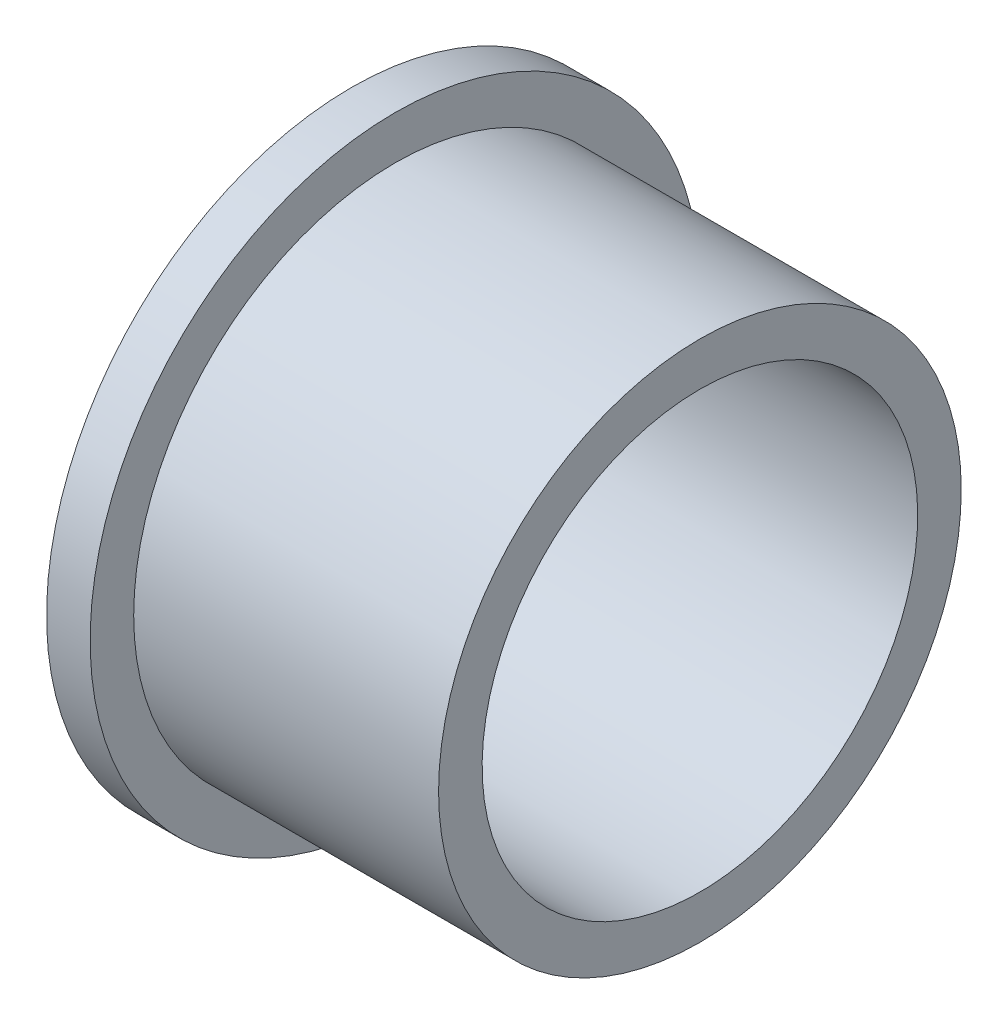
ISO-10303-21;
HEADER;
FILE_DESCRIPTION(('STEP AP214'),'2;1');
FILE_NAME('part.step','',(''),(''),'','','');
FILE_SCHEMA(('AUTOMOTIVE_DESIGN { 1 0 10303 214 1 1 1 1 }'));
ENDSEC;
DATA;
#1=APPLICATION_CONTEXT('core data for automotive mechanical design processes');
#2=APPLICATION_PROTOCOL_DEFINITION('international standard','automotive_design',2000,#1);
#3=PRODUCT_CONTEXT('',#1,'mechanical');
#4=PRODUCT('Part','Part','',(#3));
#5=PRODUCT_RELATED_PRODUCT_CATEGORY('part','',(#4));
#6=PRODUCT_DEFINITION_FORMATION('','',#4);
#7=PRODUCT_DEFINITION_CONTEXT('part definition',#1,'design');
#8=PRODUCT_DEFINITION('design','',#6,#7);
#9=PRODUCT_DEFINITION_SHAPE('','',#8);
#10=(LENGTH_UNIT() NAMED_UNIT(*) SI_UNIT(.MILLI.,.METRE.));
#11=(NAMED_UNIT(*) PLANE_ANGLE_UNIT() SI_UNIT($,.RADIAN.));
#12=(NAMED_UNIT(*) SI_UNIT($,.STERADIAN.) SOLID_ANGLE_UNIT());
#13=UNCERTAINTY_MEASURE_WITH_UNIT(LENGTH_MEASURE(1.E-05),#10,'distance_accuracy_value','');
#14=(GEOMETRIC_REPRESENTATION_CONTEXT(3) GLOBAL_UNCERTAINTY_ASSIGNED_CONTEXT((#13)) GLOBAL_UNIT_ASSIGNED_CONTEXT((#10,
#11,#12)) REPRESENTATION_CONTEXT('',''));
#15=CARTESIAN_POINT('',(0.,0.,0.));
#16=DIRECTION('',(0.,0.,1.));
#17=DIRECTION('',(1.,0.,0.));
#18=AXIS2_PLACEMENT_3D('',#15,#16,#17);
#19=CARTESIAN_POINT('',(0.,0.,0.));
#20=DIRECTION('',(1.,0.,0.));
#21=DIRECTION('',(0.,1.,0.));
#22=AXIS2_PLACEMENT_3D('',#19,#20,#21);
#23=CYLINDRICAL_SURFACE('',#22,17.5);
#24=CARTESIAN_POINT('',(-20.,0.,0.));
#25=DIRECTION('',(1.,0.,0.));
#26=DIRECTION('',(0.,1.,0.));
#27=AXIS2_PLACEMENT_3D('',#24,#25,#26);
#28=CIRCLE('',#27,17.5);
#29=CARTESIAN_POINT('',(-20.,17.5,0.));
#30=VERTEX_POINT('',#29);
#31=EDGE_CURVE('E55',#30,#30,#28,.T.);
#32=ORIENTED_EDGE('',*,*,#31,.T.);
#33=EDGE_LOOP('',(#32));
#34=FACE_BOUND('',#33,.T.);
#35=CARTESIAN_POINT('',(-17.5,0.,0.));
#36=DIRECTION('',(1.,0.,0.));
#37=DIRECTION('',(0.,1.,0.));
#38=AXIS2_PLACEMENT_3D('',#35,#36,#37);
#39=CIRCLE('',#38,17.5);
#40=CARTESIAN_POINT('',(-17.5,17.5,0.));
#41=VERTEX_POINT('',#40);
#42=EDGE_CURVE('E10',#41,#41,#39,.T.);
#43=ORIENTED_EDGE('',*,*,#42,.F.);
#44=EDGE_LOOP('',(#43));
#45=FACE_BOUND('',#44,.T.);
#46=ADVANCED_FACE('F33',(#34,#45),#23,.T.);
#47=CARTESIAN_POINT('',(-17.5,17.5,0.));
#48=DIRECTION('',(1.,0.,0.));
#49=DIRECTION('',(0.,1.,0.));
#50=AXIS2_PLACEMENT_3D('',#47,#48,#49);
#51=PLANE('',#50);
#52=ORIENTED_EDGE('',*,*,#42,.T.);
#53=EDGE_LOOP('',(#52));
#54=FACE_BOUND('',#53,.T.);
#55=CARTESIAN_POINT('',(-17.5,0.,0.));
#56=DIRECTION('',(1.,0.,0.));
#57=DIRECTION('',(0.,1.,0.));
#58=AXIS2_PLACEMENT_3D('',#55,#56,#57);
#59=CIRCLE('',#58,15.);
#60=CARTESIAN_POINT('',(-17.5,15.,0.));
#61=VERTEX_POINT('',#60);
#62=EDGE_CURVE('E39',#61,#61,#59,.T.);
#63=ORIENTED_EDGE('',*,*,#62,.F.);
#64=EDGE_LOOP('',(#63));
#65=FACE_BOUND('',#64,.T.);
#66=ADVANCED_FACE('F73',(#54,#65),#51,.T.);
#67=CARTESIAN_POINT('',(0.,0.,0.));
#68=DIRECTION('',(1.,0.,0.));
#69=DIRECTION('',(0.,1.,0.));
#70=AXIS2_PLACEMENT_3D('',#67,#68,#69);
#71=CYLINDRICAL_SURFACE('',#70,15.);
#72=ORIENTED_EDGE('',*,*,#62,.T.);
#73=EDGE_LOOP('',(#72));
#74=FACE_BOUND('',#73,.T.);
#75=CARTESIAN_POINT('',(0.,0.,0.));
#76=DIRECTION('',(1.,0.,0.));
#77=DIRECTION('',(0.,1.,0.));
#78=AXIS2_PLACEMENT_3D('',#75,#76,#77);
#79=CIRCLE('',#78,15.);
#80=CARTESIAN_POINT('',(0.,15.,0.));
#81=VERTEX_POINT('',#80);
#82=EDGE_CURVE('E43',#81,#81,#79,.T.);
#83=ORIENTED_EDGE('',*,*,#82,.F.);
#84=EDGE_LOOP('',(#83));
#85=FACE_BOUND('',#84,.T.);
#86=ADVANCED_FACE('F77',(#74,#85),#71,.T.);
#87=CARTESIAN_POINT('',(0.,15.,0.));
#88=DIRECTION('',(1.,0.,0.));
#89=DIRECTION('',(0.,1.,0.));
#90=AXIS2_PLACEMENT_3D('',#87,#88,#89);
#91=PLANE('',#90);
#92=ORIENTED_EDGE('',*,*,#82,.T.);
#93=EDGE_LOOP('',(#92));
#94=FACE_BOUND('',#93,.T.);
#95=CARTESIAN_POINT('',(0.,0.,0.));
#96=DIRECTION('',(1.,0.,0.));
#97=DIRECTION('',(0.,1.,0.));
#98=AXIS2_PLACEMENT_3D('',#95,#96,#97);
#99=CIRCLE('',#98,12.5);
#100=CARTESIAN_POINT('',(0.,12.5,0.));
#101=VERTEX_POINT('',#100);
#102=EDGE_CURVE('E47',#101,#101,#99,.T.);
#103=ORIENTED_EDGE('',*,*,#102,.F.);
#104=EDGE_LOOP('',(#103));
#105=FACE_BOUND('',#104,.T.);
#106=ADVANCED_FACE('F69',(#94,#105),#91,.T.);
#107=CARTESIAN_POINT('',(0.,0.,0.));
#108=DIRECTION('',(1.,0.,0.));
#109=DIRECTION('',(0.,1.,0.));
#110=AXIS2_PLACEMENT_3D('',#107,#108,#109);
#111=CYLINDRICAL_SURFACE('',#110,12.5);
#112=ORIENTED_EDGE('',*,*,#102,.T.);
#113=EDGE_LOOP('',(#112));
#114=FACE_BOUND('',#113,.T.);
#115=CARTESIAN_POINT('',(-20.,0.,0.));
#116=DIRECTION('',(1.,0.,0.));
#117=DIRECTION('',(0.,1.,0.));
#118=AXIS2_PLACEMENT_3D('',#115,#116,#117);
#119=CIRCLE('',#118,12.5);
#120=CARTESIAN_POINT('',(-20.,12.5,0.));
#121=VERTEX_POINT('',#120);
#122=EDGE_CURVE('E52',#121,#121,#119,.T.);
#123=ORIENTED_EDGE('',*,*,#122,.F.);
#124=EDGE_LOOP('',(#123));
#125=FACE_BOUND('',#124,.T.);
#126=ADVANCED_FACE('F63',(#114,#125),#111,.F.);
#127=CARTESIAN_POINT('',(-20.,12.5,0.));
#128=DIRECTION('',(-1.,0.,0.));
#129=DIRECTION('',(0.,-1.,0.));
#130=AXIS2_PLACEMENT_3D('',#127,#128,#129);
#131=PLANE('',#130);
#132=ORIENTED_EDGE('',*,*,#122,.T.);
#133=EDGE_LOOP('',(#132));
#134=FACE_BOUND('',#133,.T.);
#135=ORIENTED_EDGE('',*,*,#31,.F.);
#136=EDGE_LOOP('',(#135));
#137=FACE_BOUND('',#136,.T.);
#138=ADVANCED_FACE('F61',(#134,#137),#131,.T.);
#139=CLOSED_SHELL('',(#46,#66,#86,#106,#126,#138));
#140=MANIFOLD_SOLID_BREP('B2',#139);
#141=ADVANCED_BREP_SHAPE_REPRESENTATION('',(#18,#140),#14);
#142=SHAPE_DEFINITION_REPRESENTATION(#9,#141);
ENDSEC;
END-ISO-10303-21;
